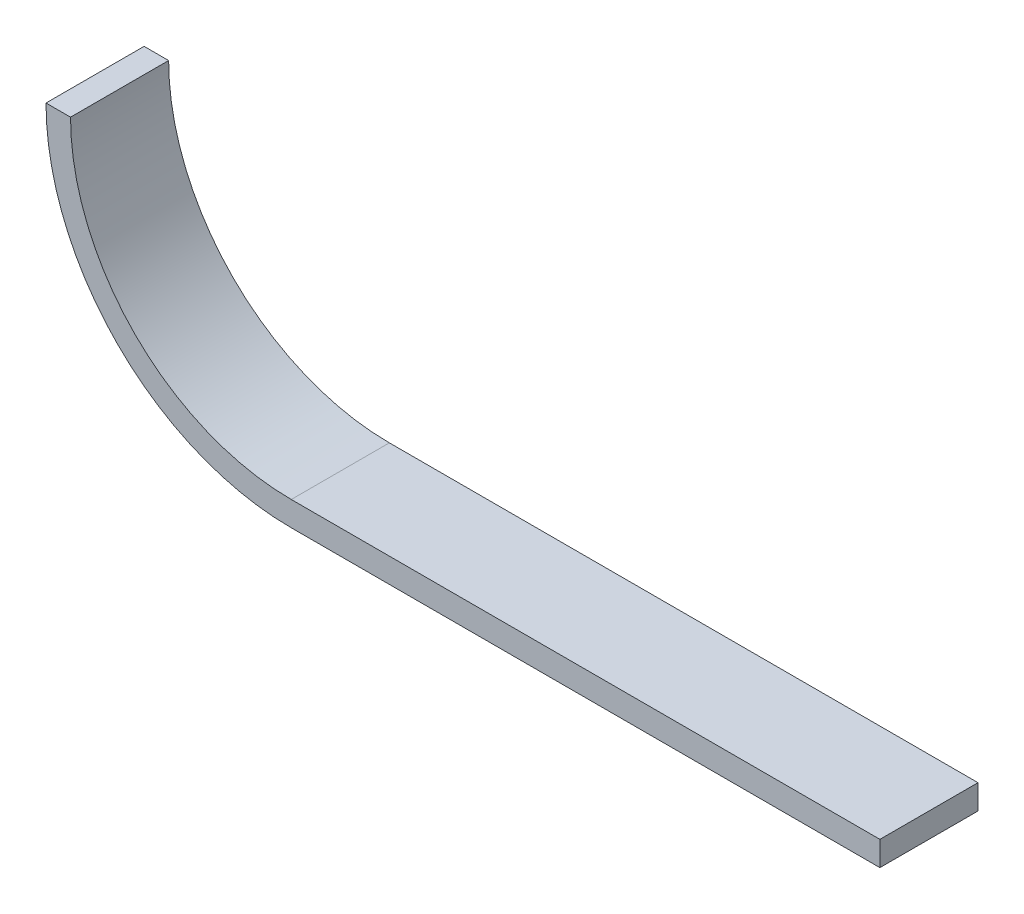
ISO-10303-21;
HEADER;
FILE_DESCRIPTION(('STEP AP214'),'2;1');
FILE_NAME('part.step','',(''),(''),'','','');
FILE_SCHEMA(('AUTOMOTIVE_DESIGN { 1 0 10303 214 1 1 1 1 }'));
ENDSEC;
DATA;
#1=APPLICATION_CONTEXT('core data for automotive mechanical design processes');
#2=APPLICATION_PROTOCOL_DEFINITION('international standard','automotive_design',2000,#1);
#3=PRODUCT_CONTEXT('',#1,'mechanical');
#4=PRODUCT('Part','Part','',(#3));
#5=PRODUCT_RELATED_PRODUCT_CATEGORY('part','',(#4));
#6=PRODUCT_DEFINITION_FORMATION('','',#4);
#7=PRODUCT_DEFINITION_CONTEXT('part definition',#1,'design');
#8=PRODUCT_DEFINITION('design','',#6,#7);
#9=PRODUCT_DEFINITION_SHAPE('','',#8);
#10=(LENGTH_UNIT() NAMED_UNIT(*) SI_UNIT(.MILLI.,.METRE.));
#11=(NAMED_UNIT(*) PLANE_ANGLE_UNIT() SI_UNIT($,.RADIAN.));
#12=(NAMED_UNIT(*) SI_UNIT($,.STERADIAN.) SOLID_ANGLE_UNIT());
#13=UNCERTAINTY_MEASURE_WITH_UNIT(LENGTH_MEASURE(1.E-05),#10,'distance_accuracy_value','');
#14=(GEOMETRIC_REPRESENTATION_CONTEXT(3) GLOBAL_UNCERTAINTY_ASSIGNED_CONTEXT((#13)) GLOBAL_UNIT_ASSIGNED_CONTEXT((#10,
#11,#12)) REPRESENTATION_CONTEXT('',''));
#15=CARTESIAN_POINT('',(0.,0.,0.));
#16=DIRECTION('',(0.,0.,1.));
#17=DIRECTION('',(1.,0.,0.));
#18=AXIS2_PLACEMENT_3D('',#15,#16,#17);
#19=CARTESIAN_POINT('',(-38.1,0.,12.7));
#20=DIRECTION('',(0.,1.,0.));
#21=DIRECTION('',(-1.,0.,0.));
#22=AXIS2_PLACEMENT_3D('',#19,#20,#21);
#23=PLANE('',#22);
#24=DIRECTION('',(0.,0.,-1.));
#25=VECTOR('',#24,1.);
#26=CARTESIAN_POINT('',(0.,0.,12.7));
#27=LINE('',#26,#25);
#28=CARTESIAN_POINT('',(0.,0.,6.35));
#29=VERTEX_POINT('',#28);
#30=CARTESIAN_POINT('',(0.,0.,0.));
#31=VERTEX_POINT('',#30);
#32=EDGE_CURVE('E11',#29,#31,#27,.T.);
#33=ORIENTED_EDGE('',*,*,#32,.F.);
#34=DIRECTION('',(1.,0.,0.));
#35=VECTOR('',#34,1.);
#36=CARTESIAN_POINT('',(-38.1,0.,6.35));
#37=LINE('',#36,#35);
#38=CARTESIAN_POINT('',(-38.1,0.,6.35));
#39=VERTEX_POINT('',#38);
#40=EDGE_CURVE('E161',#39,#29,#37,.T.);
#41=ORIENTED_EDGE('',*,*,#40,.F.);
#42=DIRECTION('',(0.,0.,-1.));
#43=VECTOR('',#42,1.);
#44=CARTESIAN_POINT('',(-38.1,0.,12.7));
#45=LINE('',#44,#43);
#46=CARTESIAN_POINT('',(-38.1,0.,0.));
#47=VERTEX_POINT('',#46);
#48=EDGE_CURVE('E187',#39,#47,#45,.T.);
#49=ORIENTED_EDGE('',*,*,#48,.T.);
#50=DIRECTION('',(1.,0.,0.));
#51=VECTOR('',#50,1.);
#52=CARTESIAN_POINT('',(-38.1,0.,0.));
#53=LINE('',#52,#51);
#54=EDGE_CURVE('E207',#47,#31,#53,.T.);
#55=ORIENTED_EDGE('',*,*,#54,.T.);
#56=EDGE_LOOP('',(#33,#41,#49,#55));
#57=FACE_BOUND('',#56,.T.);
#58=ADVANCED_FACE('F44',(#57),#23,.F.);
#59=DIRECTION('',(0.,0.,-1.));
#60=VECTOR('',#59,1.);
#61=CARTESIAN_POINT('',(0.,0.,12.7));
#62=LINE('',#61,#60);
#63=CARTESIAN_POINT('',(0.,0.,12.7));
#64=VERTEX_POINT('',#63);
#65=EDGE_CURVE('E47',#64,#29,#62,.T.);
#66=ORIENTED_EDGE('',*,*,#65,.F.);
#67=DIRECTION('',(1.,0.,0.));
#68=VECTOR('',#67,1.);
#69=CARTESIAN_POINT('',(-38.1,0.,12.7));
#70=LINE('',#69,#68);
#71=CARTESIAN_POINT('',(-38.1,0.,12.7));
#72=VERTEX_POINT('',#71);
#73=EDGE_CURVE('E222',#72,#64,#70,.T.);
#74=ORIENTED_EDGE('',*,*,#73,.F.);
#75=EDGE_CURVE('E195',#72,#39,#45,.T.);
#76=ORIENTED_EDGE('',*,*,#75,.T.);
#77=ORIENTED_EDGE('',*,*,#40,.T.);
#78=EDGE_LOOP('',(#66,#74,#76,#77));
#79=FACE_BOUND('',#78,.T.);
#80=ADVANCED_FACE('F228',(#79),#23,.F.);
#81=CARTESIAN_POINT('',(-38.1,31.75,12.7));
#82=DIRECTION('',(0.,0.,-1.));
#83=DIRECTION('',(-1.,0.,0.));
#84=AXIS2_PLACEMENT_3D('',#81,#82,#83);
#85=CYLINDRICAL_SURFACE('',#84,31.75);
#86=DIRECTION('',(0.,0.,-1.));
#87=VECTOR('',#86,1.);
#88=CARTESIAN_POINT('',(-60.5506282,9.29934759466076,12.7));
#89=LINE('',#88,#87);
#90=CARTESIAN_POINT('',(-60.5506282,9.29934759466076,6.35));
#91=VERTEX_POINT('',#90);
#92=CARTESIAN_POINT('',(-60.5506282,9.29934759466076,0.));
#93=VERTEX_POINT('',#92);
#94=EDGE_CURVE('E169',#91,#93,#89,.T.);
#95=ORIENTED_EDGE('',*,*,#94,.F.);
#96=CARTESIAN_POINT('',(-38.1,31.75,6.35));
#97=DIRECTION('',(0.,0.,1.));
#98=DIRECTION('',(1.,0.,0.));
#99=AXIS2_PLACEMENT_3D('',#96,#97,#98);
#100=CIRCLE('',#99,31.75);
#101=CARTESIAN_POINT('',(-69.85,31.75,6.35));
#102=VERTEX_POINT('',#101);
#103=EDGE_CURVE('E154',#102,#91,#100,.T.);
#104=ORIENTED_EDGE('',*,*,#103,.F.);
#105=DIRECTION('',(0.,0.,-1.));
#106=VECTOR('',#105,1.);
#107=CARTESIAN_POINT('',(-69.85,31.75,12.7));
#108=LINE('',#107,#106);
#109=CARTESIAN_POINT('',(-69.85,31.75,0.));
#110=VERTEX_POINT('',#109);
#111=EDGE_CURVE('E160',#102,#110,#108,.T.);
#112=ORIENTED_EDGE('',*,*,#111,.T.);
#113=CARTESIAN_POINT('',(-38.1,31.75,0.));
#114=DIRECTION('',(0.,0.,1.));
#115=DIRECTION('',(-1.,0.,0.));
#116=AXIS2_PLACEMENT_3D('',#113,#114,#115);
#117=CIRCLE('',#116,31.75);
#118=EDGE_CURVE('E213',#110,#93,#117,.T.);
#119=ORIENTED_EDGE('',*,*,#118,.T.);
#120=EDGE_LOOP('',(#95,#104,#112,#119));
#121=FACE_BOUND('',#120,.T.);
#122=ADVANCED_FACE('F191',(#121),#85,.T.);
#123=DIRECTION('',(0.,0.,-1.));
#124=VECTOR('',#123,1.);
#125=CARTESIAN_POINT('',(-60.5506282,9.29934759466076,12.7));
#126=LINE('',#125,#124);
#127=CARTESIAN_POINT('',(-60.5506282,9.29934759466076,12.7));
#128=VERTEX_POINT('',#127);
#129=EDGE_CURVE('E162',#128,#91,#126,.T.);
#130=ORIENTED_EDGE('',*,*,#129,.F.);
#131=CARTESIAN_POINT('',(-38.1,31.75,12.7));
#132=DIRECTION('',(0.,0.,1.));
#133=DIRECTION('',(-1.,0.,0.));
#134=AXIS2_PLACEMENT_3D('',#131,#132,#133);
#135=CIRCLE('',#134,31.75);
#136=CARTESIAN_POINT('',(-69.85,31.75,12.7));
#137=VERTEX_POINT('',#136);
#138=EDGE_CURVE('E223',#137,#128,#135,.T.);
#139=ORIENTED_EDGE('',*,*,#138,.F.);
#140=EDGE_CURVE('E133',#137,#102,#108,.T.);
#141=ORIENTED_EDGE('',*,*,#140,.T.);
#142=ORIENTED_EDGE('',*,*,#103,.T.);
#143=EDGE_LOOP('',(#130,#139,#141,#142));
#144=FACE_BOUND('',#143,.T.);
#145=ADVANCED_FACE('F188',(#144),#85,.T.);
#146=CARTESIAN_POINT('',(38.1,0.,6.35));
#147=VERTEX_POINT('',#146);
#148=EDGE_CURVE('E163',#29,#147,#37,.T.);
#149=ORIENTED_EDGE('',*,*,#148,.F.);
#150=ORIENTED_EDGE('',*,*,#32,.T.);
#151=CARTESIAN_POINT('',(38.1,0.,0.));
#152=VERTEX_POINT('',#151);
#153=EDGE_CURVE('E215',#31,#152,#53,.T.);
#154=ORIENTED_EDGE('',*,*,#153,.T.);
#155=DIRECTION('',(0.,0.,-1.));
#156=VECTOR('',#155,1.);
#157=CARTESIAN_POINT('',(38.1,0.,12.7));
#158=LINE('',#157,#156);
#159=EDGE_CURVE('E199',#147,#152,#158,.T.);
#160=ORIENTED_EDGE('',*,*,#159,.F.);
#161=EDGE_LOOP('',(#149,#150,#154,#160));
#162=FACE_BOUND('',#161,.T.);
#163=ADVANCED_FACE('F229',(#162),#23,.F.);
#164=EDGE_CURVE('E155',#91,#39,#100,.T.);
#165=ORIENTED_EDGE('',*,*,#164,.F.);
#166=ORIENTED_EDGE('',*,*,#94,.T.);
#167=EDGE_CURVE('E214',#93,#47,#117,.T.);
#168=ORIENTED_EDGE('',*,*,#167,.T.);
#169=ORIENTED_EDGE('',*,*,#48,.F.);
#170=EDGE_LOOP('',(#165,#166,#168,#169));
#171=FACE_BOUND('',#170,.T.);
#172=ADVANCED_FACE('F184',(#171),#85,.T.);
#173=CARTESIAN_POINT('',(-38.1,31.75,12.7));
#174=DIRECTION('',(0.,0.,-1.));
#175=DIRECTION('',(-1.,0.,0.));
#176=AXIS2_PLACEMENT_3D('',#173,#174,#175);
#177=CYLINDRICAL_SURFACE('',#176,28.575);
#178=CARTESIAN_POINT('',(-38.1,31.75,0.));
#179=DIRECTION('',(0.,0.,-1.));
#180=DIRECTION('',(-1.,0.,0.));
#181=AXIS2_PLACEMENT_3D('',#178,#179,#180);
#182=CIRCLE('',#181,28.575);
#183=CARTESIAN_POINT('',(-38.1,3.175,0.));
#184=VERTEX_POINT('',#183);
#185=CARTESIAN_POINT('',(-66.675,31.75,0.));
#186=VERTEX_POINT('',#185);
#187=EDGE_CURVE('E151',#184,#186,#182,.T.);
#188=ORIENTED_EDGE('',*,*,#187,.T.);
#189=DIRECTION('',(0.,0.,-1.));
#190=VECTOR('',#189,1.);
#191=CARTESIAN_POINT('',(-66.675,31.75,12.7));
#192=LINE('',#191,#190);
#193=CARTESIAN_POINT('',(-66.675,31.75,12.7));
#194=VERTEX_POINT('',#193);
#195=EDGE_CURVE('E128',#194,#186,#192,.T.);
#196=ORIENTED_EDGE('',*,*,#195,.F.);
#197=CARTESIAN_POINT('',(-38.1,31.75,12.7));
#198=DIRECTION('',(0.,0.,-1.));
#199=DIRECTION('',(-1.,0.,0.));
#200=AXIS2_PLACEMENT_3D('',#197,#198,#199);
#201=CIRCLE('',#200,28.575);
#202=CARTESIAN_POINT('',(-38.1,3.175,12.7));
#203=VERTEX_POINT('',#202);
#204=EDGE_CURVE('E138',#203,#194,#201,.T.);
#205=ORIENTED_EDGE('',*,*,#204,.F.);
#206=DIRECTION('',(0.,0.,-1.));
#207=VECTOR('',#206,1.);
#208=CARTESIAN_POINT('',(-38.1,3.175,12.7));
#209=LINE('',#208,#207);
#210=EDGE_CURVE('E204',#203,#184,#209,.T.);
#211=ORIENTED_EDGE('',*,*,#210,.T.);
#212=EDGE_LOOP('',(#188,#196,#205,#211));
#213=FACE_BOUND('',#212,.T.);
#214=ADVANCED_FACE('F50',(#213),#177,.F.);
#215=CARTESIAN_POINT('',(-66.675,31.75,12.7));
#216=DIRECTION('',(0.,-1.,0.));
#217=DIRECTION('',(0.,0.,-1.));
#218=AXIS2_PLACEMENT_3D('',#215,#216,#217);
#219=PLANE('',#218);
#220=DIRECTION('',(-1.,0.,0.));
#221=VECTOR('',#220,1.);
#222=CARTESIAN_POINT('',(-66.675,31.75,0.));
#223=LINE('',#222,#221);
#224=EDGE_CURVE('E194',#186,#110,#223,.T.);
#225=ORIENTED_EDGE('',*,*,#224,.T.);
#226=ORIENTED_EDGE('',*,*,#111,.F.);
#227=ORIENTED_EDGE('',*,*,#140,.F.);
#228=DIRECTION('',(-1.,0.,0.));
#229=VECTOR('',#228,1.);
#230=CARTESIAN_POINT('',(-66.675,31.75,12.7));
#231=LINE('',#230,#229);
#232=EDGE_CURVE('E122',#194,#137,#231,.T.);
#233=ORIENTED_EDGE('',*,*,#232,.F.);
#234=ORIENTED_EDGE('',*,*,#195,.T.);
#235=EDGE_LOOP('',(#225,#226,#227,#233,#234));
#236=FACE_BOUND('',#235,.T.);
#237=ADVANCED_FACE('F126',(#236),#219,.F.);
#238=EDGE_CURVE('E139',#128,#72,#135,.T.);
#239=ORIENTED_EDGE('',*,*,#238,.F.);
#240=ORIENTED_EDGE('',*,*,#129,.T.);
#241=ORIENTED_EDGE('',*,*,#164,.T.);
#242=ORIENTED_EDGE('',*,*,#75,.F.);
#243=EDGE_LOOP('',(#239,#240,#241,#242));
#244=FACE_BOUND('',#243,.T.);
#245=ADVANCED_FACE('F176',(#244),#85,.T.);
#246=CARTESIAN_POINT('',(38.1,0.,12.7));
#247=VERTEX_POINT('',#246);
#248=EDGE_CURVE('E221',#64,#247,#70,.T.);
#249=ORIENTED_EDGE('',*,*,#248,.F.);
#250=ORIENTED_EDGE('',*,*,#65,.T.);
#251=ORIENTED_EDGE('',*,*,#148,.T.);
#252=EDGE_CURVE('E198',#247,#147,#158,.T.);
#253=ORIENTED_EDGE('',*,*,#252,.F.);
#254=EDGE_LOOP('',(#249,#250,#251,#253));
#255=FACE_BOUND('',#254,.T.);
#256=ADVANCED_FACE('F240',(#255),#23,.F.);
#257=CARTESIAN_POINT('',(38.1,3.17500000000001,12.7));
#258=DIRECTION('',(-1.,0.,0.));
#259=DIRECTION('',(0.,-1.,0.));
#260=AXIS2_PLACEMENT_3D('',#257,#258,#259);
#261=PLANE('',#260);
#262=DIRECTION('',(0.,1.,0.));
#263=VECTOR('',#262,1.);
#264=CARTESIAN_POINT('',(38.1,3.17500000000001,0.));
#265=LINE('',#264,#263);
#266=CARTESIAN_POINT('',(38.1,3.17500000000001,0.));
#267=VERTEX_POINT('',#266);
#268=EDGE_CURVE('E210',#152,#267,#265,.T.);
#269=ORIENTED_EDGE('',*,*,#268,.T.);
#270=DIRECTION('',(0.,0.,-1.));
#271=VECTOR('',#270,1.);
#272=CARTESIAN_POINT('',(38.1,3.17500000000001,12.7));
#273=LINE('',#272,#271);
#274=CARTESIAN_POINT('',(38.1,3.17500000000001,12.7));
#275=VERTEX_POINT('',#274);
#276=EDGE_CURVE('E203',#275,#267,#273,.T.);
#277=ORIENTED_EDGE('',*,*,#276,.F.);
#278=DIRECTION('',(0.,1.,0.));
#279=VECTOR('',#278,1.);
#280=CARTESIAN_POINT('',(38.1,3.17500000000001,12.7));
#281=LINE('',#280,#279);
#282=EDGE_CURVE('E218',#247,#275,#281,.T.);
#283=ORIENTED_EDGE('',*,*,#282,.F.);
#284=ORIENTED_EDGE('',*,*,#252,.T.);
#285=ORIENTED_EDGE('',*,*,#159,.T.);
#286=EDGE_LOOP('',(#269,#277,#283,#284,#285));
#287=FACE_BOUND('',#286,.T.);
#288=ADVANCED_FACE('F243',(#287),#261,.F.);
#289=CARTESIAN_POINT('',(-38.1,3.175,12.7));
#290=DIRECTION('',(0.,-1.,0.));
#291=DIRECTION('',(1.,0.,0.));
#292=AXIS2_PLACEMENT_3D('',#289,#290,#291);
#293=PLANE('',#292);
#294=DIRECTION('',(-1.,0.,0.));
#295=VECTOR('',#294,1.);
#296=CARTESIAN_POINT('',(-38.1,3.175,0.));
#297=LINE('',#296,#295);
#298=EDGE_CURVE('E146',#267,#184,#297,.T.);
#299=ORIENTED_EDGE('',*,*,#298,.T.);
#300=ORIENTED_EDGE('',*,*,#210,.F.);
#301=DIRECTION('',(-1.,0.,0.));
#302=VECTOR('',#301,1.);
#303=CARTESIAN_POINT('',(-38.1,3.175,12.7));
#304=LINE('',#303,#302);
#305=EDGE_CURVE('E145',#275,#203,#304,.T.);
#306=ORIENTED_EDGE('',*,*,#305,.F.);
#307=ORIENTED_EDGE('',*,*,#276,.T.);
#308=EDGE_LOOP('',(#299,#300,#306,#307));
#309=FACE_BOUND('',#308,.T.);
#310=ADVANCED_FACE('F250',(#309),#293,.F.);
#311=CARTESIAN_POINT('',(-38.1,31.75,12.7));
#312=DIRECTION('',(0.,0.,-1.));
#313=DIRECTION('',(-1.,0.,0.));
#314=AXIS2_PLACEMENT_3D('',#311,#312,#313);
#315=PLANE('',#314);
#316=ORIENTED_EDGE('',*,*,#204,.T.);
#317=ORIENTED_EDGE('',*,*,#232,.T.);
#318=ORIENTED_EDGE('',*,*,#138,.T.);
#319=ORIENTED_EDGE('',*,*,#238,.T.);
#320=ORIENTED_EDGE('',*,*,#73,.T.);
#321=ORIENTED_EDGE('',*,*,#248,.T.);
#322=ORIENTED_EDGE('',*,*,#282,.T.);
#323=ORIENTED_EDGE('',*,*,#305,.T.);
#324=EDGE_LOOP('',(#316,#317,#318,#319,#320,#321,#322,#323));
#325=FACE_BOUND('',#324,.T.);
#326=ADVANCED_FACE('F142',(#325),#315,.F.);
#327=CARTESIAN_POINT('',(-38.1,31.75,0.));
#328=DIRECTION('',(0.,0.,-1.));
#329=DIRECTION('',(-1.,0.,0.));
#330=AXIS2_PLACEMENT_3D('',#327,#328,#329);
#331=PLANE('',#330);
#332=ORIENTED_EDGE('',*,*,#187,.F.);
#333=ORIENTED_EDGE('',*,*,#298,.F.);
#334=ORIENTED_EDGE('',*,*,#268,.F.);
#335=ORIENTED_EDGE('',*,*,#153,.F.);
#336=ORIENTED_EDGE('',*,*,#54,.F.);
#337=ORIENTED_EDGE('',*,*,#167,.F.);
#338=ORIENTED_EDGE('',*,*,#118,.F.);
#339=ORIENTED_EDGE('',*,*,#224,.F.);
#340=EDGE_LOOP('',(#332,#333,#334,#335,#336,#337,#338,#339));
#341=FACE_BOUND('',#340,.T.);
#342=ADVANCED_FACE('F261',(#341),#331,.T.);
#343=CLOSED_SHELL('',(#58,#80,#122,#145,#163,#172,#214,#237,#245,#256,#288,#310,#326,#342));
#344=MANIFOLD_SOLID_BREP('B2',#343);
#345=ADVANCED_BREP_SHAPE_REPRESENTATION('',(#18,#344),#14);
#346=SHAPE_DEFINITION_REPRESENTATION(#9,#345);
ENDSEC;
END-ISO-10303-21;
